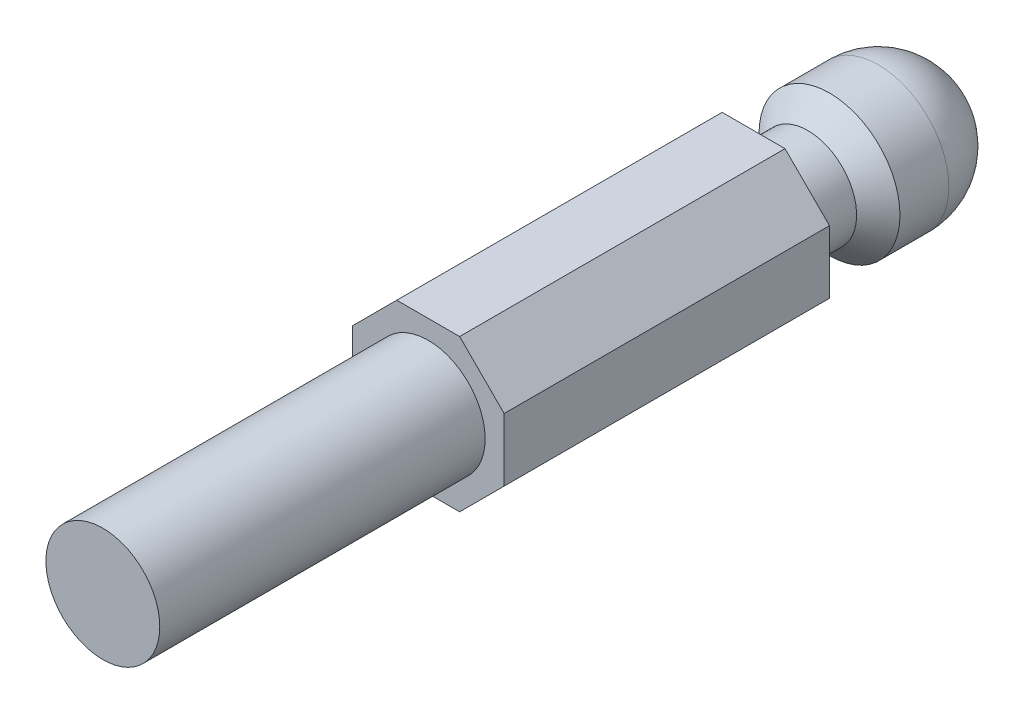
ISO-10303-21;
HEADER;
FILE_DESCRIPTION(('STEP AP214'),'2;1');
FILE_NAME('part.step','',(''),(''),'','','');
FILE_SCHEMA(('AUTOMOTIVE_DESIGN { 1 0 10303 214 1 1 1 1 }'));
ENDSEC;
DATA;
#1=APPLICATION_CONTEXT('core data for automotive mechanical design processes');
#2=APPLICATION_PROTOCOL_DEFINITION('international standard','automotive_design',2000,#1);
#3=PRODUCT_CONTEXT('',#1,'mechanical');
#4=PRODUCT('Part','Part','',(#3));
#5=PRODUCT_RELATED_PRODUCT_CATEGORY('part','',(#4));
#6=PRODUCT_DEFINITION_FORMATION('','',#4);
#7=PRODUCT_DEFINITION_CONTEXT('part definition',#1,'design');
#8=PRODUCT_DEFINITION('design','',#6,#7);
#9=PRODUCT_DEFINITION_SHAPE('','',#8);
#10=(LENGTH_UNIT() NAMED_UNIT(*) SI_UNIT(.MILLI.,.METRE.));
#11=(NAMED_UNIT(*) PLANE_ANGLE_UNIT() SI_UNIT($,.RADIAN.));
#12=(NAMED_UNIT(*) SI_UNIT($,.STERADIAN.) SOLID_ANGLE_UNIT());
#13=UNCERTAINTY_MEASURE_WITH_UNIT(LENGTH_MEASURE(1.E-05),#10,'distance_accuracy_value','');
#14=(GEOMETRIC_REPRESENTATION_CONTEXT(3) GLOBAL_UNCERTAINTY_ASSIGNED_CONTEXT((#13)) GLOBAL_UNIT_ASSIGNED_CONTEXT((#10,
#11,#12)) REPRESENTATION_CONTEXT('',''));
#15=CARTESIAN_POINT('',(0.,0.,0.));
#16=DIRECTION('',(0.,0.,1.));
#17=DIRECTION('',(1.,0.,0.));
#18=AXIS2_PLACEMENT_3D('',#15,#16,#17);
#19=CARTESIAN_POINT('',(-2.89949493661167,7.,30.));
#20=DIRECTION('',(0.707106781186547,-0.707106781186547,0.));
#21=DIRECTION('',(0.707106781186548,0.707106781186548,0.));
#22=AXIS2_PLACEMENT_3D('',#19,#20,#21);
#23=PLANE('',#22);
#24=DIRECTION('',(-0.707106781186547,-0.707106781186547,0.));
#25=VECTOR('',#24,1.);
#26=CARTESIAN_POINT('',(-2.89949493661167,7.,0.));
#27=LINE('',#26,#25);
#28=CARTESIAN_POINT('',(-2.89949493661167,7.,0.));
#29=VERTEX_POINT('',#28);
#30=CARTESIAN_POINT('',(-7.,2.89949493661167,0.));
#31=VERTEX_POINT('',#30);
#32=EDGE_CURVE('E145',#29,#31,#27,.T.);
#33=ORIENTED_EDGE('',*,*,#32,.T.);
#34=DIRECTION('',(0.,0.,-1.));
#35=VECTOR('',#34,1.);
#36=CARTESIAN_POINT('',(-7.,2.89949493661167,30.));
#37=LINE('',#36,#35);
#38=CARTESIAN_POINT('',(-7.,2.89949493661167,30.));
#39=VERTEX_POINT('',#38);
#40=EDGE_CURVE('E187',#39,#31,#37,.T.);
#41=ORIENTED_EDGE('',*,*,#40,.F.);
#42=DIRECTION('',(-0.707106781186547,-0.707106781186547,0.));
#43=VECTOR('',#42,1.);
#44=CARTESIAN_POINT('',(-2.89949493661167,7.,30.));
#45=LINE('',#44,#43);
#46=CARTESIAN_POINT('',(-2.89949493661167,7.,30.));
#47=VERTEX_POINT('',#46);
#48=EDGE_CURVE('E168',#47,#39,#45,.T.);
#49=ORIENTED_EDGE('',*,*,#48,.F.);
#50=DIRECTION('',(0.,0.,-1.));
#51=VECTOR('',#50,1.);
#52=CARTESIAN_POINT('',(-2.89949493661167,7.,30.));
#53=LINE('',#52,#51);
#54=EDGE_CURVE('E141',#47,#29,#53,.T.);
#55=ORIENTED_EDGE('',*,*,#54,.T.);
#56=EDGE_LOOP('',(#33,#41,#49,#55));
#57=FACE_BOUND('',#56,.T.);
#58=ADVANCED_FACE('F41',(#57),#23,.F.);
#59=CARTESIAN_POINT('',(-7.,2.89949493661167,30.));
#60=DIRECTION('',(1.,0.,0.));
#61=DIRECTION('',(0.,0.,-1.));
#62=AXIS2_PLACEMENT_3D('',#59,#60,#61);
#63=PLANE('',#62);
#64=DIRECTION('',(0.,-1.,0.));
#65=VECTOR('',#64,1.);
#66=CARTESIAN_POINT('',(-7.,2.89949493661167,0.));
#67=LINE('',#66,#65);
#68=CARTESIAN_POINT('',(-7.,-2.89949493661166,0.));
#69=VERTEX_POINT('',#68);
#70=EDGE_CURVE('E149',#31,#69,#67,.T.);
#71=ORIENTED_EDGE('',*,*,#70,.T.);
#72=DIRECTION('',(0.,0.,-1.));
#73=VECTOR('',#72,1.);
#74=CARTESIAN_POINT('',(-7.,-2.89949493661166,30.));
#75=LINE('',#74,#73);
#76=CARTESIAN_POINT('',(-7.,-2.89949493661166,30.));
#77=VERTEX_POINT('',#76);
#78=EDGE_CURVE('E183',#77,#69,#75,.T.);
#79=ORIENTED_EDGE('',*,*,#78,.F.);
#80=DIRECTION('',(0.,-1.,0.));
#81=VECTOR('',#80,1.);
#82=CARTESIAN_POINT('',(-7.,2.89949493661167,30.));
#83=LINE('',#82,#81);
#84=EDGE_CURVE('E104',#39,#77,#83,.T.);
#85=ORIENTED_EDGE('',*,*,#84,.F.);
#86=ORIENTED_EDGE('',*,*,#40,.T.);
#87=EDGE_LOOP('',(#71,#79,#85,#86));
#88=FACE_BOUND('',#87,.T.);
#89=ADVANCED_FACE('F244',(#88),#63,.F.);
#90=CARTESIAN_POINT('',(-7.,-2.89949493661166,30.));
#91=DIRECTION('',(0.707106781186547,0.707106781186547,0.));
#92=DIRECTION('',(-0.707106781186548,0.707106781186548,0.));
#93=AXIS2_PLACEMENT_3D('',#90,#91,#92);
#94=PLANE('',#93);
#95=DIRECTION('',(0.707106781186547,-0.707106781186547,0.));
#96=VECTOR('',#95,1.);
#97=CARTESIAN_POINT('',(-7.,-2.89949493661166,0.));
#98=LINE('',#97,#96);
#99=CARTESIAN_POINT('',(-2.89949493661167,-7.,0.));
#100=VERTEX_POINT('',#99);
#101=EDGE_CURVE('E153',#69,#100,#98,.T.);
#102=ORIENTED_EDGE('',*,*,#101,.T.);
#103=DIRECTION('',(0.,0.,-1.));
#104=VECTOR('',#103,1.);
#105=CARTESIAN_POINT('',(-2.89949493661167,-7.,30.));
#106=LINE('',#105,#104);
#107=CARTESIAN_POINT('',(-2.89949493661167,-7.,30.));
#108=VERTEX_POINT('',#107);
#109=EDGE_CURVE('E179',#108,#100,#106,.T.);
#110=ORIENTED_EDGE('',*,*,#109,.F.);
#111=DIRECTION('',(0.707106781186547,-0.707106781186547,0.));
#112=VECTOR('',#111,1.);
#113=CARTESIAN_POINT('',(-7.,-2.89949493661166,30.));
#114=LINE('',#113,#112);
#115=EDGE_CURVE('E208',#77,#108,#114,.T.);
#116=ORIENTED_EDGE('',*,*,#115,.F.);
#117=ORIENTED_EDGE('',*,*,#78,.T.);
#118=EDGE_LOOP('',(#102,#110,#116,#117));
#119=FACE_BOUND('',#118,.T.);
#120=ADVANCED_FACE('F250',(#119),#94,.F.);
#121=CARTESIAN_POINT('',(-2.89949493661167,-7.,30.));
#122=DIRECTION('',(0.,1.,0.));
#123=DIRECTION('',(0.,0.,1.));
#124=AXIS2_PLACEMENT_3D('',#121,#122,#123);
#125=PLANE('',#124);
#126=DIRECTION('',(1.,0.,0.));
#127=VECTOR('',#126,1.);
#128=CARTESIAN_POINT('',(-2.89949493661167,-7.,0.));
#129=LINE('',#128,#127);
#130=CARTESIAN_POINT('',(2.89949493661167,-7.,0.));
#131=VERTEX_POINT('',#130);
#132=EDGE_CURVE('E156',#100,#131,#129,.T.);
#133=ORIENTED_EDGE('',*,*,#132,.T.);
#134=DIRECTION('',(0.,0.,-1.));
#135=VECTOR('',#134,1.);
#136=CARTESIAN_POINT('',(2.89949493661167,-7.,30.));
#137=LINE('',#136,#135);
#138=CARTESIAN_POINT('',(2.89949493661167,-7.,30.));
#139=VERTEX_POINT('',#138);
#140=EDGE_CURVE('E175',#139,#131,#137,.T.);
#141=ORIENTED_EDGE('',*,*,#140,.F.);
#142=DIRECTION('',(1.,0.,0.));
#143=VECTOR('',#142,1.);
#144=CARTESIAN_POINT('',(-2.89949493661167,-7.,30.));
#145=LINE('',#144,#143);
#146=EDGE_CURVE('E211',#108,#139,#145,.T.);
#147=ORIENTED_EDGE('',*,*,#146,.F.);
#148=ORIENTED_EDGE('',*,*,#109,.T.);
#149=EDGE_LOOP('',(#133,#141,#147,#148));
#150=FACE_BOUND('',#149,.T.);
#151=ADVANCED_FACE('F341',(#150),#125,.F.);
#152=CARTESIAN_POINT('',(2.89949493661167,-7.,30.));
#153=DIRECTION('',(-0.707106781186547,0.707106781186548,0.));
#154=DIRECTION('',(-0.707106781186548,-0.707106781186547,0.));
#155=AXIS2_PLACEMENT_3D('',#152,#153,#154);
#156=PLANE('',#155);
#157=DIRECTION('',(0.707106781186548,0.707106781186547,0.));
#158=VECTOR('',#157,1.);
#159=CARTESIAN_POINT('',(2.89949493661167,-7.,0.));
#160=LINE('',#159,#158);
#161=CARTESIAN_POINT('',(7.,-2.89949493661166,0.));
#162=VERTEX_POINT('',#161);
#163=EDGE_CURVE('E159',#131,#162,#160,.T.);
#164=ORIENTED_EDGE('',*,*,#163,.T.);
#165=DIRECTION('',(0.,0.,-1.));
#166=VECTOR('',#165,1.);
#167=CARTESIAN_POINT('',(7.,-2.89949493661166,30.));
#168=LINE('',#167,#166);
#169=CARTESIAN_POINT('',(7.,-2.89949493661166,30.));
#170=VERTEX_POINT('',#169);
#171=EDGE_CURVE('E134',#170,#162,#168,.T.);
#172=ORIENTED_EDGE('',*,*,#171,.F.);
#173=DIRECTION('',(0.707106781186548,0.707106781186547,0.));
#174=VECTOR('',#173,1.);
#175=CARTESIAN_POINT('',(2.89949493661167,-7.,30.));
#176=LINE('',#175,#174);
#177=EDGE_CURVE('E123',#139,#170,#176,.T.);
#178=ORIENTED_EDGE('',*,*,#177,.F.);
#179=ORIENTED_EDGE('',*,*,#140,.T.);
#180=EDGE_LOOP('',(#164,#172,#178,#179));
#181=FACE_BOUND('',#180,.T.);
#182=ADVANCED_FACE('F332',(#181),#156,.F.);
#183=CARTESIAN_POINT('',(7.,-2.89949493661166,30.));
#184=DIRECTION('',(-1.,0.,0.));
#185=DIRECTION('',(0.,0.,1.));
#186=AXIS2_PLACEMENT_3D('',#183,#184,#185);
#187=PLANE('',#186);
#188=DIRECTION('',(0.,1.,0.));
#189=VECTOR('',#188,1.);
#190=CARTESIAN_POINT('',(7.,-2.89949493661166,0.));
#191=LINE('',#190,#189);
#192=CARTESIAN_POINT('',(7.,2.89949493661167,0.));
#193=VERTEX_POINT('',#192);
#194=EDGE_CURVE('E132',#162,#193,#191,.T.);
#195=ORIENTED_EDGE('',*,*,#194,.T.);
#196=DIRECTION('',(0.,0.,-1.));
#197=VECTOR('',#196,1.);
#198=CARTESIAN_POINT('',(7.,2.89949493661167,30.));
#199=LINE('',#198,#197);
#200=CARTESIAN_POINT('',(7.,2.89949493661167,30.));
#201=VERTEX_POINT('',#200);
#202=EDGE_CURVE('E129',#201,#193,#199,.T.);
#203=ORIENTED_EDGE('',*,*,#202,.F.);
#204=DIRECTION('',(0.,1.,0.));
#205=VECTOR('',#204,1.);
#206=CARTESIAN_POINT('',(7.,-2.89949493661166,30.));
#207=LINE('',#206,#205);
#208=EDGE_CURVE('E117',#170,#201,#207,.T.);
#209=ORIENTED_EDGE('',*,*,#208,.F.);
#210=ORIENTED_EDGE('',*,*,#171,.T.);
#211=EDGE_LOOP('',(#195,#203,#209,#210));
#212=FACE_BOUND('',#211,.T.);
#213=ADVANCED_FACE('F130',(#212),#187,.F.);
#214=CARTESIAN_POINT('',(7.,2.89949493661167,30.));
#215=DIRECTION('',(-0.707106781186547,-0.707106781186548,0.));
#216=DIRECTION('',(0.707106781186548,-0.707106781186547,0.));
#217=AXIS2_PLACEMENT_3D('',#214,#215,#216);
#218=PLANE('',#217);
#219=DIRECTION('',(-0.707106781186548,0.707106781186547,0.));
#220=VECTOR('',#219,1.);
#221=CARTESIAN_POINT('',(7.,2.89949493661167,0.));
#222=LINE('',#221,#220);
#223=CARTESIAN_POINT('',(2.89949493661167,7.,0.));
#224=VERTEX_POINT('',#223);
#225=EDGE_CURVE('E89',#193,#224,#222,.T.);
#226=ORIENTED_EDGE('',*,*,#225,.T.);
#227=DIRECTION('',(0.,0.,-1.));
#228=VECTOR('',#227,1.);
#229=CARTESIAN_POINT('',(2.89949493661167,7.,30.));
#230=LINE('',#229,#228);
#231=CARTESIAN_POINT('',(2.89949493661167,7.,30.));
#232=VERTEX_POINT('',#231);
#233=EDGE_CURVE('E135',#232,#224,#230,.T.);
#234=ORIENTED_EDGE('',*,*,#233,.F.);
#235=DIRECTION('',(-0.707106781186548,0.707106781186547,0.));
#236=VECTOR('',#235,1.);
#237=CARTESIAN_POINT('',(7.,2.89949493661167,30.));
#238=LINE('',#237,#236);
#239=EDGE_CURVE('E121',#201,#232,#238,.T.);
#240=ORIENTED_EDGE('',*,*,#239,.F.);
#241=ORIENTED_EDGE('',*,*,#202,.T.);
#242=EDGE_LOOP('',(#226,#234,#240,#241));
#243=FACE_BOUND('',#242,.T.);
#244=ADVANCED_FACE('F137',(#243),#218,.F.);
#245=CARTESIAN_POINT('',(2.89949493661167,7.,30.));
#246=DIRECTION('',(0.,-1.,0.));
#247=DIRECTION('',(1.,0.,0.));
#248=AXIS2_PLACEMENT_3D('',#245,#246,#247);
#249=PLANE('',#248);
#250=DIRECTION('',(-1.,0.,0.));
#251=VECTOR('',#250,1.);
#252=CARTESIAN_POINT('',(2.89949493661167,7.,0.));
#253=LINE('',#252,#251);
#254=EDGE_CURVE('E95',#224,#29,#253,.T.);
#255=ORIENTED_EDGE('',*,*,#254,.T.);
#256=ORIENTED_EDGE('',*,*,#54,.F.);
#257=DIRECTION('',(-1.,0.,0.));
#258=VECTOR('',#257,1.);
#259=CARTESIAN_POINT('',(2.89949493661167,7.,30.));
#260=LINE('',#259,#258);
#261=EDGE_CURVE('E60',#232,#47,#260,.T.);
#262=ORIENTED_EDGE('',*,*,#261,.F.);
#263=ORIENTED_EDGE('',*,*,#233,.T.);
#264=EDGE_LOOP('',(#255,#256,#262,#263));
#265=FACE_BOUND('',#264,.T.);
#266=ADVANCED_FACE('F232',(#265),#249,.F.);
#267=CARTESIAN_POINT('',(0.,0.,30.));
#268=DIRECTION('',(0.,0.,1.));
#269=DIRECTION('',(1.,0.,0.));
#270=AXIS2_PLACEMENT_3D('',#267,#268,#269);
#271=PLANE('',#270);
#272=CARTESIAN_POINT('',(0.,0.,30.));
#273=DIRECTION('',(0.,0.,1.));
#274=DIRECTION('',(1.,0.,0.));
#275=AXIS2_PLACEMENT_3D('',#272,#273,#274);
#276=CIRCLE('',#275,5.25);
#277=CARTESIAN_POINT('',(5.25,0.,30.));
#278=VERTEX_POINT('',#277);
#279=EDGE_CURVE('E11',#278,#278,#276,.T.);
#280=ORIENTED_EDGE('',*,*,#279,.F.);
#281=EDGE_LOOP('',(#280));
#282=FACE_BOUND('',#281,.T.);
#283=ORIENTED_EDGE('',*,*,#48,.T.);
#284=ORIENTED_EDGE('',*,*,#84,.T.);
#285=ORIENTED_EDGE('',*,*,#115,.T.);
#286=ORIENTED_EDGE('',*,*,#146,.T.);
#287=ORIENTED_EDGE('',*,*,#177,.T.);
#288=ORIENTED_EDGE('',*,*,#208,.T.);
#289=ORIENTED_EDGE('',*,*,#239,.T.);
#290=ORIENTED_EDGE('',*,*,#261,.T.);
#291=EDGE_LOOP('',(#283,#284,#285,#286,#287,#288,#289,#290));
#292=FACE_BOUND('',#291,.T.);
#293=ADVANCED_FACE('F119',(#282,#292),#271,.T.);
#294=CARTESIAN_POINT('',(0.,0.,0.));
#295=DIRECTION('',(0.,0.,1.));
#296=DIRECTION('',(1.,0.,0.));
#297=AXIS2_PLACEMENT_3D('',#294,#295,#296);
#298=PLANE('',#297);
#299=CARTESIAN_POINT('',(0.,0.,0.));
#300=DIRECTION('',(0.,0.,-1.));
#301=DIRECTION('',(-1.,0.,0.));
#302=AXIS2_PLACEMENT_3D('',#299,#300,#301);
#303=CIRCLE('',#302,4.5);
#304=CARTESIAN_POINT('',(-4.5,0.,0.));
#305=VERTEX_POINT('',#304);
#306=EDGE_CURVE('E189',#305,#305,#303,.T.);
#307=ORIENTED_EDGE('',*,*,#306,.F.);
#308=EDGE_LOOP('',(#307));
#309=FACE_BOUND('',#308,.T.);
#310=ORIENTED_EDGE('',*,*,#32,.F.);
#311=ORIENTED_EDGE('',*,*,#254,.F.);
#312=ORIENTED_EDGE('',*,*,#225,.F.);
#313=ORIENTED_EDGE('',*,*,#194,.F.);
#314=ORIENTED_EDGE('',*,*,#163,.F.);
#315=ORIENTED_EDGE('',*,*,#132,.F.);
#316=ORIENTED_EDGE('',*,*,#101,.F.);
#317=ORIENTED_EDGE('',*,*,#70,.F.);
#318=EDGE_LOOP('',(#310,#311,#312,#313,#314,#315,#316,#317));
#319=FACE_BOUND('',#318,.T.);
#320=ADVANCED_FACE('F231',(#309,#319),#298,.F.);
#321=CARTESIAN_POINT('',(0.,0.,-7.));
#322=DIRECTION('',(0.,0.,1.));
#323=DIRECTION('',(1.,0.,0.));
#324=AXIS2_PLACEMENT_3D('',#321,#322,#323);
#325=CYLINDRICAL_SURFACE('',#324,4.5);
#326=CARTESIAN_POINT('',(0.,0.,-5.));
#327=DIRECTION('',(0.,0.,-1.));
#328=DIRECTION('',(-1.,0.,0.));
#329=AXIS2_PLACEMENT_3D('',#326,#327,#328);
#330=CIRCLE('',#329,4.5);
#331=CARTESIAN_POINT('',(-4.5,0.,-5.));
#332=VERTEX_POINT('',#331);
#333=EDGE_CURVE('E190',#332,#332,#330,.F.);
#334=ORIENTED_EDGE('',*,*,#333,.T.);
#335=EDGE_LOOP('',(#334));
#336=FACE_BOUND('',#335,.T.);
#337=ORIENTED_EDGE('',*,*,#306,.T.);
#338=EDGE_LOOP('',(#337));
#339=FACE_BOUND('',#338,.T.);
#340=ADVANCED_FACE('F238',(#336,#339),#325,.T.);
#341=CARTESIAN_POINT('',(0.,0.,-18.));
#342=DIRECTION('',(0.,0.,1.));
#343=DIRECTION('',(1.,0.,0.));
#344=AXIS2_PLACEMENT_3D('',#341,#342,#343);
#345=CYLINDRICAL_SURFACE('',#344,6.5);
#346=CARTESIAN_POINT('',(0.,0.,-11.5));
#347=DIRECTION('',(0.,0.,1.));
#348=DIRECTION('',(1.,0.,0.));
#349=AXIS2_PLACEMENT_3D('',#346,#347,#348);
#350=CIRCLE('',#349,6.5);
#351=CARTESIAN_POINT('',(6.5,0.,-11.5));
#352=VERTEX_POINT('',#351);
#353=EDGE_CURVE('E45',#352,#352,#350,.T.);
#354=ORIENTED_EDGE('',*,*,#353,.T.);
#355=EDGE_LOOP('',(#354));
#356=FACE_BOUND('',#355,.T.);
#357=CARTESIAN_POINT('',(0.,0.,-7.));
#358=DIRECTION('',(0.,0.,-1.));
#359=DIRECTION('',(-1.,0.,0.));
#360=AXIS2_PLACEMENT_3D('',#357,#358,#359);
#361=CIRCLE('',#360,6.5);
#362=CARTESIAN_POINT('',(-6.5,0.,-7.));
#363=VERTEX_POINT('',#362);
#364=EDGE_CURVE('E150',#363,#363,#361,.T.);
#365=ORIENTED_EDGE('',*,*,#364,.T.);
#366=EDGE_LOOP('',(#365));
#367=FACE_BOUND('',#366,.T.);
#368=ADVANCED_FACE('F258',(#356,#367),#345,.T.);
#369=CARTESIAN_POINT('',(0.,0.,-7.));
#370=DIRECTION('',(0.,0.,-1.));
#371=DIRECTION('',(-1.,0.,0.));
#372=AXIS2_PLACEMENT_3D('',#369,#370,#371);
#373=CONICAL_SURFACE('',#372,6.50000000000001,0.785398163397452);
#374=ORIENTED_EDGE('',*,*,#333,.F.);
#375=EDGE_LOOP('',(#374));
#376=FACE_BOUND('',#375,.T.);
#377=ORIENTED_EDGE('',*,*,#364,.F.);
#378=EDGE_LOOP('',(#377));
#379=FACE_BOUND('',#378,.T.);
#380=ADVANCED_FACE('F254',(#376,#379),#373,.T.);
#381=CARTESIAN_POINT('',(0.,0.,-11.5));
#382=DIRECTION('',(0.,0.,-1.));
#383=DIRECTION('',(-1.,0.,0.));
#384=AXIS2_PLACEMENT_3D('',#381,#382,#383);
#385=SPHERICAL_SURFACE('',#384,6.5);
#386=ORIENTED_EDGE('',*,*,#353,.F.);
#387=EDGE_LOOP('',(#386));
#388=FACE_BOUND('',#387,.T.);
#389=ADVANCED_FACE('F43',(#388),#385,.T.);
#390=CARTESIAN_POINT('',(0.,0.,60.));
#391=DIRECTION('',(0.,0.,-1.));
#392=DIRECTION('',(-1.,0.,0.));
#393=AXIS2_PLACEMENT_3D('',#390,#391,#392);
#394=CYLINDRICAL_SURFACE('',#393,5.25);
#395=CARTESIAN_POINT('',(0.,0.,60.));
#396=DIRECTION('',(0.,0.,1.));
#397=DIRECTION('',(1.,0.,0.));
#398=AXIS2_PLACEMENT_3D('',#395,#396,#397);
#399=CIRCLE('',#398,5.25);
#400=CARTESIAN_POINT('',(5.25,0.,60.));
#401=VERTEX_POINT('',#400);
#402=EDGE_CURVE('E217',#401,#401,#399,.T.);
#403=ORIENTED_EDGE('',*,*,#402,.F.);
#404=EDGE_LOOP('',(#403));
#405=FACE_BOUND('',#404,.T.);
#406=ORIENTED_EDGE('',*,*,#279,.T.);
#407=EDGE_LOOP('',(#406));
#408=FACE_BOUND('',#407,.T.);
#409=ADVANCED_FACE('F224',(#405,#408),#394,.T.);
#410=CARTESIAN_POINT('',(0.,0.,60.));
#411=DIRECTION('',(0.,0.,1.));
#412=DIRECTION('',(1.,0.,0.));
#413=AXIS2_PLACEMENT_3D('',#410,#411,#412);
#414=PLANE('',#413);
#415=ORIENTED_EDGE('',*,*,#402,.T.);
#416=EDGE_LOOP('',(#415));
#417=FACE_BOUND('',#416,.T.);
#418=ADVANCED_FACE('F222',(#417),#414,.T.);
#419=CLOSED_SHELL('',(#58,#89,#120,#151,#182,#213,#244,#266,#293,#320,#340,#368,#380,#389,#409,#418));
#420=MANIFOLD_SOLID_BREP('B2',#419);
#421=ADVANCED_BREP_SHAPE_REPRESENTATION('',(#18,#420),#14);
#422=SHAPE_DEFINITION_REPRESENTATION(#9,#421);
ENDSEC;
END-ISO-10303-21;
